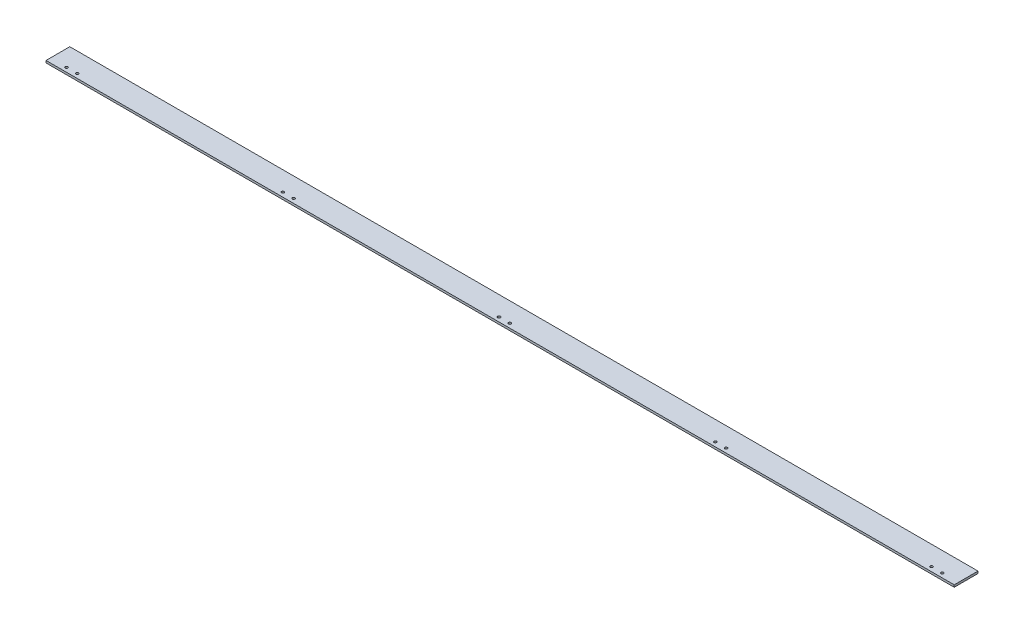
ISO-10303-21;
HEADER;
FILE_DESCRIPTION(('STEP AP214'),'2;1');
FILE_NAME('part.step','',(''),(''),'','','');
FILE_SCHEMA(('AUTOMOTIVE_DESIGN { 1 0 10303 214 1 1 1 1 }'));
ENDSEC;
DATA;
#1=APPLICATION_CONTEXT('core data for automotive mechanical design processes');
#2=APPLICATION_PROTOCOL_DEFINITION('international standard','automotive_design',2000,#1);
#3=PRODUCT_CONTEXT('',#1,'mechanical');
#4=PRODUCT('Part','Part','',(#3));
#5=PRODUCT_RELATED_PRODUCT_CATEGORY('part','',(#4));
#6=PRODUCT_DEFINITION_FORMATION('','',#4);
#7=PRODUCT_DEFINITION_CONTEXT('part definition',#1,'design');
#8=PRODUCT_DEFINITION('design','',#6,#7);
#9=PRODUCT_DEFINITION_SHAPE('','',#8);
#10=(LENGTH_UNIT() NAMED_UNIT(*) SI_UNIT(.MILLI.,.METRE.));
#11=(NAMED_UNIT(*) PLANE_ANGLE_UNIT() SI_UNIT($,.RADIAN.));
#12=(NAMED_UNIT(*) SI_UNIT($,.STERADIAN.) SOLID_ANGLE_UNIT());
#13=UNCERTAINTY_MEASURE_WITH_UNIT(LENGTH_MEASURE(1.E-05),#10,'distance_accuracy_value','');
#14=(GEOMETRIC_REPRESENTATION_CONTEXT(3) GLOBAL_UNCERTAINTY_ASSIGNED_CONTEXT((#13)) GLOBAL_UNIT_ASSIGNED_CONTEXT((#10,
#11,#12)) REPRESENTATION_CONTEXT('',''));
#15=CARTESIAN_POINT('',(0.,0.,0.));
#16=DIRECTION('',(0.,0.,1.));
#17=DIRECTION('',(1.,0.,0.));
#18=AXIS2_PLACEMENT_3D('',#15,#16,#17);
#19=CARTESIAN_POINT('',(0.,10.,0.));
#20=DIRECTION('',(1.,0.,0.));
#21=DIRECTION('',(0.,0.,-1.));
#22=AXIS2_PLACEMENT_3D('',#19,#20,#21);
#23=PLANE('',#22);
#24=DIRECTION('',(0.,0.,1.));
#25=VECTOR('',#24,1.);
#26=CARTESIAN_POINT('',(0.,0.,0.));
#27=LINE('',#26,#25);
#28=CARTESIAN_POINT('',(0.,0.,-110.));
#29=VERTEX_POINT('',#28);
#30=CARTESIAN_POINT('',(0.,0.,0.));
#31=VERTEX_POINT('',#30);
#32=EDGE_CURVE('E76',#29,#31,#27,.T.);
#33=ORIENTED_EDGE('',*,*,#32,.T.);
#34=DIRECTION('',(0.,-1.,0.));
#35=VECTOR('',#34,1.);
#36=CARTESIAN_POINT('',(0.,10.,0.));
#37=LINE('',#36,#35);
#38=CARTESIAN_POINT('',(0.,10.,0.));
#39=VERTEX_POINT('',#38);
#40=EDGE_CURVE('E11',#39,#31,#37,.T.);
#41=ORIENTED_EDGE('',*,*,#40,.F.);
#42=DIRECTION('',(0.,0.,1.));
#43=VECTOR('',#42,1.);
#44=CARTESIAN_POINT('',(0.,10.,0.));
#45=LINE('',#44,#43);
#46=CARTESIAN_POINT('',(0.,10.,-110.));
#47=VERTEX_POINT('',#46);
#48=EDGE_CURVE('E99',#47,#39,#45,.T.);
#49=ORIENTED_EDGE('',*,*,#48,.F.);
#50=DIRECTION('',(0.,-1.,0.));
#51=VECTOR('',#50,1.);
#52=CARTESIAN_POINT('',(0.,10.,-110.));
#53=LINE('',#52,#51);
#54=EDGE_CURVE('E88',#47,#29,#53,.T.);
#55=ORIENTED_EDGE('',*,*,#54,.T.);
#56=EDGE_LOOP('',(#33,#41,#49,#55));
#57=FACE_BOUND('',#56,.T.);
#58=ADVANCED_FACE('F32',(#57),#23,.F.);
#59=CARTESIAN_POINT('',(0.,10.,0.));
#60=DIRECTION('',(0.,0.,-1.));
#61=DIRECTION('',(-1.,0.,0.));
#62=AXIS2_PLACEMENT_3D('',#59,#60,#61);
#63=PLANE('',#62);
#64=DIRECTION('',(1.,0.,0.));
#65=VECTOR('',#64,1.);
#66=CARTESIAN_POINT('',(0.,0.,0.));
#67=LINE('',#66,#65);
#68=CARTESIAN_POINT('',(4200.,0.,0.));
#69=VERTEX_POINT('',#68);
#70=EDGE_CURVE('E72',#31,#69,#67,.T.);
#71=ORIENTED_EDGE('',*,*,#70,.T.);
#72=DIRECTION('',(0.,-1.,0.));
#73=VECTOR('',#72,1.);
#74=CARTESIAN_POINT('',(4200.,10.,0.));
#75=LINE('',#74,#73);
#76=CARTESIAN_POINT('',(4200.,10.,0.));
#77=VERTEX_POINT('',#76);
#78=EDGE_CURVE('E39',#77,#69,#75,.T.);
#79=ORIENTED_EDGE('',*,*,#78,.F.);
#80=DIRECTION('',(1.,0.,0.));
#81=VECTOR('',#80,1.);
#82=CARTESIAN_POINT('',(0.,10.,0.));
#83=LINE('',#82,#81);
#84=EDGE_CURVE('E84',#39,#77,#83,.T.);
#85=ORIENTED_EDGE('',*,*,#84,.F.);
#86=ORIENTED_EDGE('',*,*,#40,.T.);
#87=EDGE_LOOP('',(#71,#79,#85,#86));
#88=FACE_BOUND('',#87,.T.);
#89=ADVANCED_FACE('F83',(#88),#63,.F.);
#90=CARTESIAN_POINT('',(4200.,10.,0.));
#91=DIRECTION('',(-1.,0.,0.));
#92=DIRECTION('',(0.,0.,1.));
#93=AXIS2_PLACEMENT_3D('',#90,#91,#92);
#94=PLANE('',#93);
#95=DIRECTION('',(0.,0.,-1.));
#96=VECTOR('',#95,1.);
#97=CARTESIAN_POINT('',(4200.,0.,0.));
#98=LINE('',#97,#96);
#99=CARTESIAN_POINT('',(4200.,0.,-110.));
#100=VERTEX_POINT('',#99);
#101=EDGE_CURVE('E77',#69,#100,#98,.T.);
#102=ORIENTED_EDGE('',*,*,#101,.T.);
#103=DIRECTION('',(0.,-1.,0.));
#104=VECTOR('',#103,1.);
#105=CARTESIAN_POINT('',(4200.,10.,-110.));
#106=LINE('',#105,#104);
#107=CARTESIAN_POINT('',(4200.,10.,-110.));
#108=VERTEX_POINT('',#107);
#109=EDGE_CURVE('E105',#108,#100,#106,.T.);
#110=ORIENTED_EDGE('',*,*,#109,.F.);
#111=DIRECTION('',(0.,0.,-1.));
#112=VECTOR('',#111,1.);
#113=CARTESIAN_POINT('',(4200.,10.,0.));
#114=LINE('',#113,#112);
#115=EDGE_CURVE('E51',#77,#108,#114,.T.);
#116=ORIENTED_EDGE('',*,*,#115,.F.);
#117=ORIENTED_EDGE('',*,*,#78,.T.);
#118=EDGE_LOOP('',(#102,#110,#116,#117));
#119=FACE_BOUND('',#118,.T.);
#120=ADVANCED_FACE('F108',(#119),#94,.F.);
#121=CARTESIAN_POINT('',(0.,10.,-110.));
#122=DIRECTION('',(0.,0.,1.));
#123=DIRECTION('',(1.,0.,0.));
#124=AXIS2_PLACEMENT_3D('',#121,#122,#123);
#125=PLANE('',#124);
#126=DIRECTION('',(-1.,0.,0.));
#127=VECTOR('',#126,1.);
#128=CARTESIAN_POINT('',(0.,0.,-110.));
#129=LINE('',#128,#127);
#130=EDGE_CURVE('E97',#100,#29,#129,.T.);
#131=ORIENTED_EDGE('',*,*,#130,.T.);
#132=ORIENTED_EDGE('',*,*,#54,.F.);
#133=DIRECTION('',(-1.,0.,0.));
#134=VECTOR('',#133,1.);
#135=CARTESIAN_POINT('',(0.,10.,-110.));
#136=LINE('',#135,#134);
#137=EDGE_CURVE('E46',#108,#47,#136,.T.);
#138=ORIENTED_EDGE('',*,*,#137,.F.);
#139=ORIENTED_EDGE('',*,*,#109,.T.);
#140=EDGE_LOOP('',(#131,#132,#138,#139));
#141=FACE_BOUND('',#140,.T.);
#142=ADVANCED_FACE('F110',(#141),#125,.F.);
#143=CARTESIAN_POINT('',(0.,10.,-110.));
#144=DIRECTION('',(0.,-1.,0.));
#145=DIRECTION('',(0.,0.,-1.));
#146=AXIS2_PLACEMENT_3D('',#143,#144,#145);
#147=PLANE('',#146);
#148=CARTESIAN_POINT('',(75.0000000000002,10.,-20.));
#149=DIRECTION('',(0.,1.,0.));
#150=DIRECTION('',(0.,0.,1.));
#151=AXIS2_PLACEMENT_3D('',#148,#149,#150);
#152=CIRCLE('',#151,6.00000000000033);
#153=CARTESIAN_POINT('',(75.0000000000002,10.,-13.9999999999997));
#154=VERTEX_POINT('',#153);
#155=EDGE_CURVE('E257',#154,#154,#152,.T.);
#156=ORIENTED_EDGE('',*,*,#155,.F.);
#157=EDGE_LOOP('',(#156));
#158=FACE_BOUND('',#157,.T.);
#159=CARTESIAN_POINT('',(125.,10.,-20.));
#160=DIRECTION('',(0.,1.,0.));
#161=DIRECTION('',(0.,0.,1.));
#162=AXIS2_PLACEMENT_3D('',#159,#160,#161);
#163=CIRCLE('',#162,6.00000000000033);
#164=CARTESIAN_POINT('',(125.,10.,-13.9999999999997));
#165=VERTEX_POINT('',#164);
#166=EDGE_CURVE('E259',#165,#165,#163,.T.);
#167=ORIENTED_EDGE('',*,*,#166,.F.);
#168=EDGE_LOOP('',(#167));
#169=FACE_BOUND('',#168,.T.);
#170=CARTESIAN_POINT('',(1075.,10.,-20.));
#171=DIRECTION('',(0.,1.,0.));
#172=DIRECTION('',(0.,0.,1.));
#173=AXIS2_PLACEMENT_3D('',#170,#171,#172);
#174=CIRCLE('',#173,6.00000000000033);
#175=CARTESIAN_POINT('',(1075.,10.,-13.9999999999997));
#176=VERTEX_POINT('',#175);
#177=EDGE_CURVE('E267',#176,#176,#174,.T.);
#178=ORIENTED_EDGE('',*,*,#177,.F.);
#179=EDGE_LOOP('',(#178));
#180=FACE_BOUND('',#179,.T.);
#181=CARTESIAN_POINT('',(1125.,10.,-20.));
#182=DIRECTION('',(0.,1.,0.));
#183=DIRECTION('',(0.,0.,1.));
#184=AXIS2_PLACEMENT_3D('',#181,#182,#183);
#185=CIRCLE('',#184,6.00000000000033);
#186=CARTESIAN_POINT('',(1125.,10.,-13.9999999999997));
#187=VERTEX_POINT('',#186);
#188=EDGE_CURVE('E273',#187,#187,#185,.T.);
#189=ORIENTED_EDGE('',*,*,#188,.F.);
#190=EDGE_LOOP('',(#189));
#191=FACE_BOUND('',#190,.T.);
#192=CARTESIAN_POINT('',(2075.,10.,-20.));
#193=DIRECTION('',(0.,1.,0.));
#194=DIRECTION('',(0.,0.,1.));
#195=AXIS2_PLACEMENT_3D('',#192,#193,#194);
#196=CIRCLE('',#195,6.00000000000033);
#197=CARTESIAN_POINT('',(2075.,10.,-13.9999999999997));
#198=VERTEX_POINT('',#197);
#199=EDGE_CURVE('E279',#198,#198,#196,.T.);
#200=ORIENTED_EDGE('',*,*,#199,.F.);
#201=EDGE_LOOP('',(#200));
#202=FACE_BOUND('',#201,.T.);
#203=CARTESIAN_POINT('',(2125.,10.,-20.));
#204=DIRECTION('',(0.,1.,0.));
#205=DIRECTION('',(0.,0.,1.));
#206=AXIS2_PLACEMENT_3D('',#203,#204,#205);
#207=CIRCLE('',#206,6.00000000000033);
#208=CARTESIAN_POINT('',(2125.,10.,-13.9999999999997));
#209=VERTEX_POINT('',#208);
#210=EDGE_CURVE('E285',#209,#209,#207,.T.);
#211=ORIENTED_EDGE('',*,*,#210,.F.);
#212=EDGE_LOOP('',(#211));
#213=FACE_BOUND('',#212,.T.);
#214=CARTESIAN_POINT('',(3075.,10.,-20.));
#215=DIRECTION('',(0.,1.,0.));
#216=DIRECTION('',(0.,0.,1.));
#217=AXIS2_PLACEMENT_3D('',#214,#215,#216);
#218=CIRCLE('',#217,6.00000000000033);
#219=CARTESIAN_POINT('',(3075.,10.,-13.9999999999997));
#220=VERTEX_POINT('',#219);
#221=EDGE_CURVE('E291',#220,#220,#218,.T.);
#222=ORIENTED_EDGE('',*,*,#221,.F.);
#223=EDGE_LOOP('',(#222));
#224=FACE_BOUND('',#223,.T.);
#225=CARTESIAN_POINT('',(3125.,10.,-20.));
#226=DIRECTION('',(0.,1.,0.));
#227=DIRECTION('',(0.,0.,1.));
#228=AXIS2_PLACEMENT_3D('',#225,#226,#227);
#229=CIRCLE('',#228,6.00000000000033);
#230=CARTESIAN_POINT('',(3125.,10.,-13.9999999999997));
#231=VERTEX_POINT('',#230);
#232=EDGE_CURVE('E297',#231,#231,#229,.T.);
#233=ORIENTED_EDGE('',*,*,#232,.F.);
#234=EDGE_LOOP('',(#233));
#235=FACE_BOUND('',#234,.T.);
#236=CARTESIAN_POINT('',(4075.,10.,-20.));
#237=DIRECTION('',(0.,1.,0.));
#238=DIRECTION('',(0.,0.,1.));
#239=AXIS2_PLACEMENT_3D('',#236,#237,#238);
#240=CIRCLE('',#239,6.00000000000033);
#241=CARTESIAN_POINT('',(4075.,10.,-13.9999999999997));
#242=VERTEX_POINT('',#241);
#243=EDGE_CURVE('E303',#242,#242,#240,.T.);
#244=ORIENTED_EDGE('',*,*,#243,.F.);
#245=EDGE_LOOP('',(#244));
#246=FACE_BOUND('',#245,.T.);
#247=CARTESIAN_POINT('',(4125.,10.,-20.));
#248=DIRECTION('',(0.,1.,0.));
#249=DIRECTION('',(0.,0.,1.));
#250=AXIS2_PLACEMENT_3D('',#247,#248,#249);
#251=CIRCLE('',#250,6.00000000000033);
#252=CARTESIAN_POINT('',(4125.,10.,-13.9999999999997));
#253=VERTEX_POINT('',#252);
#254=EDGE_CURVE('E92',#253,#253,#251,.T.);
#255=ORIENTED_EDGE('',*,*,#254,.F.);
#256=EDGE_LOOP('',(#255));
#257=FACE_BOUND('',#256,.T.);
#258=ORIENTED_EDGE('',*,*,#48,.T.);
#259=ORIENTED_EDGE('',*,*,#84,.T.);
#260=ORIENTED_EDGE('',*,*,#115,.T.);
#261=ORIENTED_EDGE('',*,*,#137,.T.);
#262=EDGE_LOOP('',(#258,#259,#260,#261));
#263=FACE_BOUND('',#262,.T.);
#264=ADVANCED_FACE('F111',(#158,#169,#180,#191,#202,#213,#224,#235,#246,#257,#263),#147,.F.);
#265=CARTESIAN_POINT('',(0.,0.,-110.));
#266=DIRECTION('',(0.,-1.,0.));
#267=DIRECTION('',(0.,0.,-1.));
#268=AXIS2_PLACEMENT_3D('',#265,#266,#267);
#269=PLANE('',#268);
#270=CARTESIAN_POINT('',(75.0000000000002,0.,-20.));
#271=DIRECTION('',(0.,1.,0.));
#272=DIRECTION('',(0.,0.,1.));
#273=AXIS2_PLACEMENT_3D('',#270,#271,#272);
#274=CIRCLE('',#273,6.00000000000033);
#275=CARTESIAN_POINT('',(75.0000000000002,0.,-13.9999999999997));
#276=VERTEX_POINT('',#275);
#277=EDGE_CURVE('E255',#276,#276,#274,.T.);
#278=ORIENTED_EDGE('',*,*,#277,.T.);
#279=EDGE_LOOP('',(#278));
#280=FACE_BOUND('',#279,.T.);
#281=CARTESIAN_POINT('',(125.,0.,-20.));
#282=DIRECTION('',(0.,1.,0.));
#283=DIRECTION('',(0.,0.,1.));
#284=AXIS2_PLACEMENT_3D('',#281,#282,#283);
#285=CIRCLE('',#284,6.00000000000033);
#286=CARTESIAN_POINT('',(125.,0.,-13.9999999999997));
#287=VERTEX_POINT('',#286);
#288=EDGE_CURVE('E264',#287,#287,#285,.T.);
#289=ORIENTED_EDGE('',*,*,#288,.T.);
#290=EDGE_LOOP('',(#289));
#291=FACE_BOUND('',#290,.T.);
#292=CARTESIAN_POINT('',(1075.,0.,-20.));
#293=DIRECTION('',(0.,1.,0.));
#294=DIRECTION('',(0.,0.,1.));
#295=AXIS2_PLACEMENT_3D('',#292,#293,#294);
#296=CIRCLE('',#295,6.00000000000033);
#297=CARTESIAN_POINT('',(1075.,0.,-13.9999999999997));
#298=VERTEX_POINT('',#297);
#299=EDGE_CURVE('E270',#298,#298,#296,.T.);
#300=ORIENTED_EDGE('',*,*,#299,.T.);
#301=EDGE_LOOP('',(#300));
#302=FACE_BOUND('',#301,.T.);
#303=CARTESIAN_POINT('',(1125.,0.,-20.));
#304=DIRECTION('',(0.,1.,0.));
#305=DIRECTION('',(0.,0.,1.));
#306=AXIS2_PLACEMENT_3D('',#303,#304,#305);
#307=CIRCLE('',#306,6.00000000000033);
#308=CARTESIAN_POINT('',(1125.,0.,-13.9999999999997));
#309=VERTEX_POINT('',#308);
#310=EDGE_CURVE('E276',#309,#309,#307,.T.);
#311=ORIENTED_EDGE('',*,*,#310,.T.);
#312=EDGE_LOOP('',(#311));
#313=FACE_BOUND('',#312,.T.);
#314=CARTESIAN_POINT('',(2075.,0.,-20.));
#315=DIRECTION('',(0.,1.,0.));
#316=DIRECTION('',(0.,0.,1.));
#317=AXIS2_PLACEMENT_3D('',#314,#315,#316);
#318=CIRCLE('',#317,6.00000000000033);
#319=CARTESIAN_POINT('',(2075.,0.,-13.9999999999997));
#320=VERTEX_POINT('',#319);
#321=EDGE_CURVE('E282',#320,#320,#318,.T.);
#322=ORIENTED_EDGE('',*,*,#321,.T.);
#323=EDGE_LOOP('',(#322));
#324=FACE_BOUND('',#323,.T.);
#325=CARTESIAN_POINT('',(2125.,0.,-20.));
#326=DIRECTION('',(0.,1.,0.));
#327=DIRECTION('',(0.,0.,1.));
#328=AXIS2_PLACEMENT_3D('',#325,#326,#327);
#329=CIRCLE('',#328,6.00000000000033);
#330=CARTESIAN_POINT('',(2125.,0.,-13.9999999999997));
#331=VERTEX_POINT('',#330);
#332=EDGE_CURVE('E288',#331,#331,#329,.T.);
#333=ORIENTED_EDGE('',*,*,#332,.T.);
#334=EDGE_LOOP('',(#333));
#335=FACE_BOUND('',#334,.T.);
#336=CARTESIAN_POINT('',(3075.,0.,-20.));
#337=DIRECTION('',(0.,1.,0.));
#338=DIRECTION('',(0.,0.,1.));
#339=AXIS2_PLACEMENT_3D('',#336,#337,#338);
#340=CIRCLE('',#339,6.00000000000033);
#341=CARTESIAN_POINT('',(3075.,0.,-13.9999999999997));
#342=VERTEX_POINT('',#341);
#343=EDGE_CURVE('E294',#342,#342,#340,.T.);
#344=ORIENTED_EDGE('',*,*,#343,.T.);
#345=EDGE_LOOP('',(#344));
#346=FACE_BOUND('',#345,.T.);
#347=CARTESIAN_POINT('',(3125.,0.,-20.));
#348=DIRECTION('',(0.,1.,0.));
#349=DIRECTION('',(0.,0.,1.));
#350=AXIS2_PLACEMENT_3D('',#347,#348,#349);
#351=CIRCLE('',#350,6.00000000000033);
#352=CARTESIAN_POINT('',(3125.,0.,-13.9999999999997));
#353=VERTEX_POINT('',#352);
#354=EDGE_CURVE('E300',#353,#353,#351,.T.);
#355=ORIENTED_EDGE('',*,*,#354,.T.);
#356=EDGE_LOOP('',(#355));
#357=FACE_BOUND('',#356,.T.);
#358=CARTESIAN_POINT('',(4075.,0.,-20.));
#359=DIRECTION('',(0.,1.,0.));
#360=DIRECTION('',(0.,0.,1.));
#361=AXIS2_PLACEMENT_3D('',#358,#359,#360);
#362=CIRCLE('',#361,6.00000000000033);
#363=CARTESIAN_POINT('',(4075.,0.,-13.9999999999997));
#364=VERTEX_POINT('',#363);
#365=EDGE_CURVE('E306',#364,#364,#362,.T.);
#366=ORIENTED_EDGE('',*,*,#365,.T.);
#367=EDGE_LOOP('',(#366));
#368=FACE_BOUND('',#367,.T.);
#369=CARTESIAN_POINT('',(4125.,0.,-20.));
#370=DIRECTION('',(0.,1.,0.));
#371=DIRECTION('',(0.,0.,1.));
#372=AXIS2_PLACEMENT_3D('',#369,#370,#371);
#373=CIRCLE('',#372,6.00000000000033);
#374=CARTESIAN_POINT('',(4125.,0.,-13.9999999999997));
#375=VERTEX_POINT('',#374);
#376=EDGE_CURVE('E89',#375,#375,#373,.T.);
#377=ORIENTED_EDGE('',*,*,#376,.T.);
#378=EDGE_LOOP('',(#377));
#379=FACE_BOUND('',#378,.T.);
#380=ORIENTED_EDGE('',*,*,#32,.F.);
#381=ORIENTED_EDGE('',*,*,#130,.F.);
#382=ORIENTED_EDGE('',*,*,#101,.F.);
#383=ORIENTED_EDGE('',*,*,#70,.F.);
#384=EDGE_LOOP('',(#380,#381,#382,#383));
#385=FACE_BOUND('',#384,.T.);
#386=ADVANCED_FACE('F73',(#280,#291,#302,#313,#324,#335,#346,#357,#368,#379,#385),#269,.T.);
#387=CARTESIAN_POINT('',(4125.,0.,-20.));
#388=DIRECTION('',(0.,1.,0.));
#389=DIRECTION('',(0.,0.,1.));
#390=AXIS2_PLACEMENT_3D('',#387,#388,#389);
#391=CYLINDRICAL_SURFACE('',#390,6.00000000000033);
#392=ORIENTED_EDGE('',*,*,#376,.F.);
#393=EDGE_LOOP('',(#392));
#394=FACE_BOUND('',#393,.T.);
#395=ORIENTED_EDGE('',*,*,#254,.T.);
#396=EDGE_LOOP('',(#395));
#397=FACE_BOUND('',#396,.T.);
#398=ADVANCED_FACE('F119',(#394,#397),#391,.F.);
#399=CARTESIAN_POINT('',(4075.,0.,-20.));
#400=DIRECTION('',(0.,1.,0.));
#401=DIRECTION('',(0.,0.,1.));
#402=AXIS2_PLACEMENT_3D('',#399,#400,#401);
#403=CYLINDRICAL_SURFACE('',#402,6.00000000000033);
#404=ORIENTED_EDGE('',*,*,#365,.F.);
#405=EDGE_LOOP('',(#404));
#406=FACE_BOUND('',#405,.T.);
#407=ORIENTED_EDGE('',*,*,#243,.T.);
#408=EDGE_LOOP('',(#407));
#409=FACE_BOUND('',#408,.T.);
#410=ADVANCED_FACE('F158',(#406,#409),#403,.F.);
#411=CARTESIAN_POINT('',(3125.,0.,-20.));
#412=DIRECTION('',(0.,1.,0.));
#413=DIRECTION('',(0.,0.,1.));
#414=AXIS2_PLACEMENT_3D('',#411,#412,#413);
#415=CYLINDRICAL_SURFACE('',#414,6.00000000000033);
#416=ORIENTED_EDGE('',*,*,#354,.F.);
#417=EDGE_LOOP('',(#416));
#418=FACE_BOUND('',#417,.T.);
#419=ORIENTED_EDGE('',*,*,#232,.T.);
#420=EDGE_LOOP('',(#419));
#421=FACE_BOUND('',#420,.T.);
#422=ADVANCED_FACE('F168',(#418,#421),#415,.F.);
#423=CARTESIAN_POINT('',(3075.,0.,-20.));
#424=DIRECTION('',(0.,1.,0.));
#425=DIRECTION('',(0.,0.,1.));
#426=AXIS2_PLACEMENT_3D('',#423,#424,#425);
#427=CYLINDRICAL_SURFACE('',#426,6.00000000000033);
#428=ORIENTED_EDGE('',*,*,#343,.F.);
#429=EDGE_LOOP('',(#428));
#430=FACE_BOUND('',#429,.T.);
#431=ORIENTED_EDGE('',*,*,#221,.T.);
#432=EDGE_LOOP('',(#431));
#433=FACE_BOUND('',#432,.T.);
#434=ADVANCED_FACE('F178',(#430,#433),#427,.F.);
#435=CARTESIAN_POINT('',(2125.,0.,-20.));
#436=DIRECTION('',(0.,1.,0.));
#437=DIRECTION('',(0.,0.,1.));
#438=AXIS2_PLACEMENT_3D('',#435,#436,#437);
#439=CYLINDRICAL_SURFACE('',#438,6.00000000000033);
#440=ORIENTED_EDGE('',*,*,#332,.F.);
#441=EDGE_LOOP('',(#440));
#442=FACE_BOUND('',#441,.T.);
#443=ORIENTED_EDGE('',*,*,#210,.T.);
#444=EDGE_LOOP('',(#443));
#445=FACE_BOUND('',#444,.T.);
#446=ADVANCED_FACE('F188',(#442,#445),#439,.F.);
#447=CARTESIAN_POINT('',(2075.,0.,-20.));
#448=DIRECTION('',(0.,1.,0.));
#449=DIRECTION('',(0.,0.,1.));
#450=AXIS2_PLACEMENT_3D('',#447,#448,#449);
#451=CYLINDRICAL_SURFACE('',#450,6.00000000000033);
#452=ORIENTED_EDGE('',*,*,#321,.F.);
#453=EDGE_LOOP('',(#452));
#454=FACE_BOUND('',#453,.T.);
#455=ORIENTED_EDGE('',*,*,#199,.T.);
#456=EDGE_LOOP('',(#455));
#457=FACE_BOUND('',#456,.T.);
#458=ADVANCED_FACE('F198',(#454,#457),#451,.F.);
#459=CARTESIAN_POINT('',(1125.,0.,-20.));
#460=DIRECTION('',(0.,1.,0.));
#461=DIRECTION('',(0.,0.,1.));
#462=AXIS2_PLACEMENT_3D('',#459,#460,#461);
#463=CYLINDRICAL_SURFACE('',#462,6.00000000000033);
#464=ORIENTED_EDGE('',*,*,#310,.F.);
#465=EDGE_LOOP('',(#464));
#466=FACE_BOUND('',#465,.T.);
#467=ORIENTED_EDGE('',*,*,#188,.T.);
#468=EDGE_LOOP('',(#467));
#469=FACE_BOUND('',#468,.T.);
#470=ADVANCED_FACE('F208',(#466,#469),#463,.F.);
#471=CARTESIAN_POINT('',(1075.,0.,-20.));
#472=DIRECTION('',(0.,1.,0.));
#473=DIRECTION('',(0.,0.,1.));
#474=AXIS2_PLACEMENT_3D('',#471,#472,#473);
#475=CYLINDRICAL_SURFACE('',#474,6.00000000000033);
#476=ORIENTED_EDGE('',*,*,#299,.F.);
#477=EDGE_LOOP('',(#476));
#478=FACE_BOUND('',#477,.T.);
#479=ORIENTED_EDGE('',*,*,#177,.T.);
#480=EDGE_LOOP('',(#479));
#481=FACE_BOUND('',#480,.T.);
#482=ADVANCED_FACE('F218',(#478,#481),#475,.F.);
#483=CARTESIAN_POINT('',(125.,0.,-20.));
#484=DIRECTION('',(0.,1.,0.));
#485=DIRECTION('',(0.,0.,1.));
#486=AXIS2_PLACEMENT_3D('',#483,#484,#485);
#487=CYLINDRICAL_SURFACE('',#486,6.00000000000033);
#488=ORIENTED_EDGE('',*,*,#288,.F.);
#489=EDGE_LOOP('',(#488));
#490=FACE_BOUND('',#489,.T.);
#491=ORIENTED_EDGE('',*,*,#166,.T.);
#492=EDGE_LOOP('',(#491));
#493=FACE_BOUND('',#492,.T.);
#494=ADVANCED_FACE('F228',(#490,#493),#487,.F.);
#495=CARTESIAN_POINT('',(75.0000000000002,0.,-20.));
#496=DIRECTION('',(0.,1.,0.));
#497=DIRECTION('',(0.,0.,1.));
#498=AXIS2_PLACEMENT_3D('',#495,#496,#497);
#499=CYLINDRICAL_SURFACE('',#498,6.00000000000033);
#500=ORIENTED_EDGE('',*,*,#277,.F.);
#501=EDGE_LOOP('',(#500));
#502=FACE_BOUND('',#501,.T.);
#503=ORIENTED_EDGE('',*,*,#155,.T.);
#504=EDGE_LOOP('',(#503));
#505=FACE_BOUND('',#504,.T.);
#506=ADVANCED_FACE('F238',(#502,#505),#499,.F.);
#507=CLOSED_SHELL('',(#58,#89,#120,#142,#264,#386,#398,#410,#422,#434,#446,#458,#470,#482,#494,#506));
#508=MANIFOLD_SOLID_BREP('B2',#507);
#509=ADVANCED_BREP_SHAPE_REPRESENTATION('',(#18,#508),#14);
#510=SHAPE_DEFINITION_REPRESENTATION(#9,#509);
ENDSEC;
END-ISO-10303-21;
